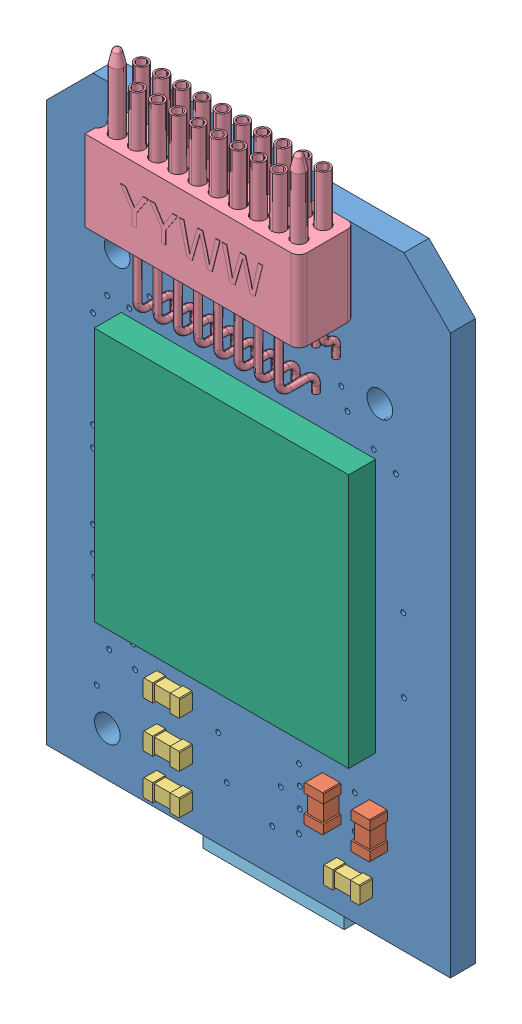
SolidWorks assembly RHD2132_accel_16.SLDASM, configuration Default (file format 15000). Lengths in mm.
Overall size (12.7 22.53 4.76).
16 component instances, 7 part files, 30 mates.
Components (placement in the parent):
- RHD2132_accel_16_PCB-1: RHD2132_accel_16_PCB.SLDPRT [Default] at origin size (12.7 19.02 0.79)
- 0402c_2320560-1: 0402c_2320560.sldprt [Default] at (8.9535 3.0099 0.7874) x (0 -1 0) z (0 0 1) size (1.15 0.6 0.55)
- 0402c_2320560-2: 0402c_2320560.sldprt [Default] at (2.2225 10.2743 0) x (-1 0 0) z (0 0 -1) size (1.15 0.6 0.55)
- 0402c_2320560-3: 0402c_2320560.sldprt [Default] at (10.4267 3.0099 0.7874) x (0 -1 0) z (0 0 1) size (1.15 0.6 0.55)
- 0402c_2320560-4: 0402c_2320560.sldprt [Default] at (3.5814 7.493 0) x (1 0 0) z (0 0 -1) size (1.15 0.6 0.55)
- 0402c_2320560-5: 0402c_2320560.sldprt [Default] at (6.2357 7.493 0) x (1 0 0) z (0 0 -1) size (1.15 0.6 0.55)
- 0402c_2320560-6: 0402c_2320560.sldprt [Default] at (8.7884 7.493 0) x (1 0 0) z (0 0 -1) size (1.15 0.6 0.55)
- 0402r_1430758-1: 0402r_1430758.sldprt [Default] at (1.905 16.51 0.7874) x (0 1 0) z (0 0 1) size (1.15 0.55 0.4)
- 0402r_1430758-2: 0402r_1430758.sldprt [Default] at (9.6774 1.2192 0.7874) x (-1 0 0) z (0 0 1) size (1.15 0.55 0.4)
- 0402r_1430758-3: 0402r_1430758.sldprt [Default] at (4.0132 3.4798 0.7874) size (1.15 0.55 0.4)
- 0402r_1430758-4: 0402r_1430758.sldprt [Default] at (4.0132 2.032 0.7874) size (1.15 0.55 0.4)
- 0402r_1430758-5: 0402r_1430758.sldprt [Default] at (4.0132 0.762 0.7874) size (1.15 0.55 0.4)
- A79041-001-1: A79041-001.SLDPRT [Default] at (6.35 17.7546 1.6764) x (-1 0 0) z (0 1 0) size (6.73 2.08 7.44)
- A79623-001-1: A79623-001.SLDPRT [Default] at (6.35 3.175 0) x (-1 0 0) z (0 -1 0) size (4.45 2.05 6.53)
- QFN_8x8mm-1: QFN_8x8mm.SLDPRT [Default] at (2.35 4.9535 0.7874) x (1 0 0) z (0 -1 0) size (8 0.85 8)
- ADXL335-1: ADXL335.SLDPRT [Default] at (6.4135 10.414 0) x (-1 0 0) z (0 0 -1) size (4.14 4.14 1.5)
Mates (geometry in assembly coordinates):
- Coincident1: coincident anti-aligned: plane of RHD2132_accel_16-1 through (0 0 0.7874) normal (0 0 1); plane of QFN_8x8mm-1 through (2.35 4.9535 0.7874) normal (0 0 -1)
- Parallel1: parallel aligned: plane of RHD2132_accel_16-1 through (0 0 0.7874) normal (0 -1 0); plane of QFN_8x8mm-1 through (2.35 4.9535 1.6374) normal (0 -1 0)
- Coincident2: coincident anti-aligned: plane of RHD2132_accel_16-1 through (0 0 0.7874) normal (0 0 1); plane of A79041-001-1 through (9.7155 16.4846 0.7874) normal (0 0 -1)
- Parallel3: parallel aligned: plane of RHD2132_accel_16-1 through (11.2395 19.0246 0.7874) normal (0 1 0); plane of A79041-001-1 through (9.7155 19.0246 2.5654) normal (0 1 0)
- Coincident3: coincident anti-aligned: plane of RHD2132_accel_16-1 through (0 0 0) normal (0 0 -1); plane of A79623-001-1 through (6.35 3.175 0) normal (0 0 1)
- Parallel4: parallel aligned: plane of RHD2132_accel_16-1 through (0 0 0.7874) normal (0 -1 0); plane of A79623-001-1 through (4.1275 -1.143 0) normal (0 -1 0)
- Coincident5: coincident anti-aligned: plane of RHD2132_accel_16-1 through (0 0 0) normal (0 0 -1); plane of ADXL335-1 through (8.4835 11.567 0) normal (0 0 1)
- Parallel5: parallel aligned: plane of RHD2132_accel_16-1 through (0 0 0.7874) normal (0 -1 0); plane of ADXL335-1 through (8.4835 8.344 -0.051) normal (0 -1 0)
- Coincident7: coincident: plane of RHD2132_accel_16-1 through (0 0 0.7874) normal (0 0 1); plane of 0402r_1430758-1 through (1.08 16.51 0.7874) normal (0 0 -1)
- Parallel6: parallel aligned: plane of RHD2132_accel_16-1 through (11.2395 19.0246 0.7874) normal (0 1 0); plane of 0402r_1430758-1 through (2.155 17.085 1.1874) normal (0 1 0)
- Coincident9: coincident: plane of RHD2132_accel_16-1 through (0 0 0.7874) normal (0 0 1); plane of 0402r_1430758-3 through (4.0132 4.3048 0.7874) normal (0 0 -1)
- Parallel7: parallel aligned: plane of RHD2132_accel_16-1 through (0 17.5641 0.7874) normal (-1 0 0); plane of 0402r_1430758-3 through (3.4382 3.7298 1.1874) normal (-1 0 0)
- Coincident11: coincident: plane of RHD2132_accel_16-1 through (0 0 0.7874) normal (0 0 1); plane of 0402r_1430758-4 through (4.0132 2.857 0.7874) normal (0 0 -1)
- Parallel8: parallel aligned: plane of RHD2132_accel_16-1 through (0 17.5641 0.7874) normal (-1 0 0); plane of 0402r_1430758-4 through (3.4382 2.282 1.1874) normal (-1 0 0)
- Coincident13: coincident: plane of RHD2132_accel_16-1 through (0 0 0.7874) normal (0 0 1); plane of 0402r_1430758-5 through (4.0132 1.587 0.7874) normal (0 0 -1)
- Parallel9: parallel aligned: plane of RHD2132_accel_16-1 through (0 17.5641 0.7874) normal (-1 0 0); plane of 0402r_1430758-5 through (3.4382 1.012 1.1874) normal (-1 0 0)
- Coincident15: coincident: plane of RHD2132_accel_16-1 through (0 0 0.7874) normal (0 0 1); plane of 0402r_1430758-2 through (9.6774 0.3942 0.7874) normal (0 0 -1)
- Parallel10: parallel aligned: plane of RHD2132_accel_16-1 through (12.7 0 0.7874) normal (1 0 0); plane of 0402r_1430758-2 through (10.2524 0.9692 1.1874) normal (1 0 0)
- Coincident17: coincident: plane of RHD2132_accel_16-1 through (0 0 0.7874) normal (0 0 1); plane of 0402c_2320560-1 through (9.8035 3.0099 0.7874) normal (0 0 -1)
- Parallel11: parallel aligned: plane of RHD2132_accel_16-1 through (0 0 0.7874) normal (0 -1 0); plane of 0402c_2320560-1 through (8.6785 2.4349 1.3374) normal (0 -1 0)
- Coincident19: coincident: plane of RHD2132_accel_16-1 through (0 0 0.7874) normal (0 0 1); plane of 0402c_2320560-3 through (11.2767 3.0099 0.7874) normal (0 0 -1)
- Parallel12: parallel aligned: plane of RHD2132_accel_16-1 through (0 0 0.7874) normal (0 -1 0); plane of 0402c_2320560-3 through (10.1517 2.4349 1.3374) normal (0 -1 0)
- Coincident21: coincident: plane of RHD2132_accel_16-1 through (0 0 0) normal (0 0 -1); plane of 0402c_2320560-6 through (8.7884 6.643 0) normal (0 0 1)
- Parallel13: parallel aligned: plane of RHD2132_accel_16-1 through (12.7 0 0.7874) normal (1 0 0); plane of 0402c_2320560-6 through (9.3634 7.768 -0.55) normal (1 0 0)
- Coincident23: coincident: plane of RHD2132_accel_16-1 through (0 0 0) normal (0 0 -1); plane of 0402c_2320560-5 through (6.2357 6.643 0) normal (0 0 1)
- Parallel14: parallel aligned: plane of RHD2132_accel_16-1 through (12.7 0 0.7874) normal (1 0 0); plane of 0402c_2320560-5 through (6.8107 7.768 -0.55) normal (1 0 0)
- Coincident25: coincident: plane of RHD2132_accel_16-1 through (0 0 0) normal (0 0 -1); plane of 0402c_2320560-4 through (3.5814 6.643 0) normal (0 0 1)
- Parallel15: parallel aligned: plane of RHD2132_accel_16-1 through (0 17.5641 0.7874) normal (-1 0 0); plane of 0402c_2320560-4 through (3.0064 7.218 -0.55) normal (-1 0 0)
- Coincident27: coincident: plane of RHD2132_accel_16-1 through (0 0 0) normal (0 0 -1); plane of 0402c_2320560-2 through (2.2225 11.1243 0) normal (0 0 1)
- Parallel16: parallel aligned: plane of RHD2132_accel_16-1 through (0 17.5641 0.7874) normal (-1 0 0); plane of 0402c_2320560-2 through (1.6475 9.9993 -0.55) normal (-1 0 0)
